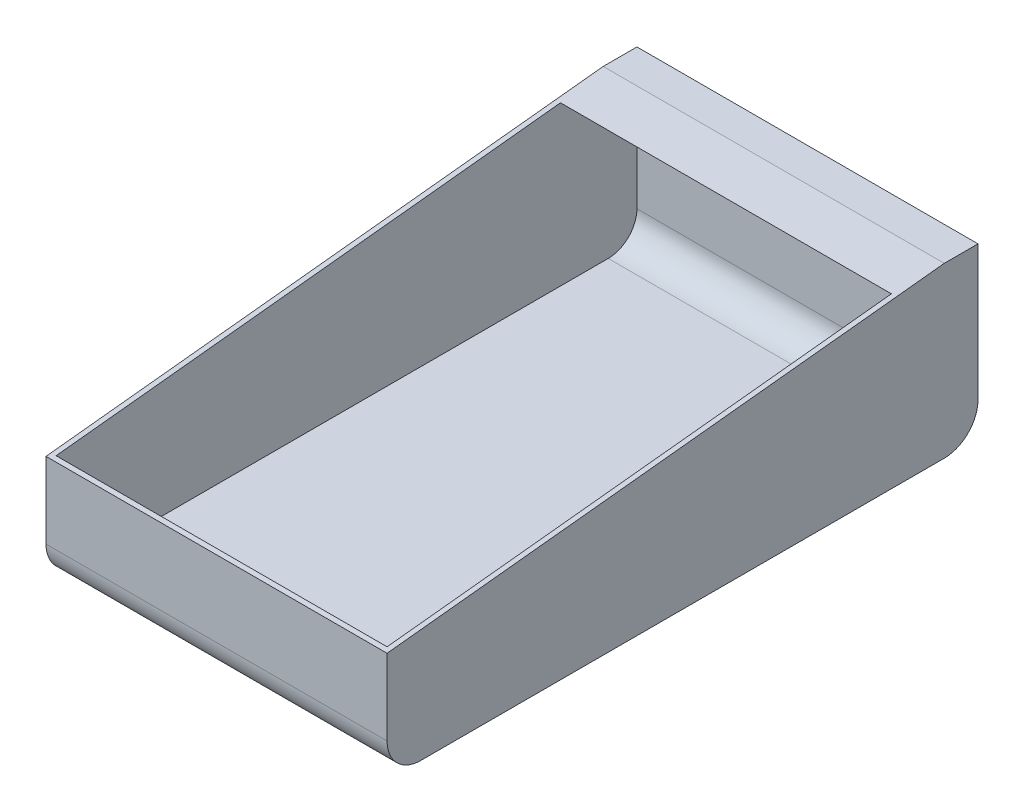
ISO-10303-21;
HEADER;
FILE_DESCRIPTION(('STEP AP214'),'2;1');
FILE_NAME('part.step','',(''),(''),'','','');
FILE_SCHEMA(('AUTOMOTIVE_DESIGN { 1 0 10303 214 1 1 1 1 }'));
ENDSEC;
DATA;
#1=APPLICATION_CONTEXT('core data for automotive mechanical design processes');
#2=APPLICATION_PROTOCOL_DEFINITION('international standard','automotive_design',2000,#1);
#3=PRODUCT_CONTEXT('',#1,'mechanical');
#4=PRODUCT('Part','Part','',(#3));
#5=PRODUCT_RELATED_PRODUCT_CATEGORY('part','',(#4));
#6=PRODUCT_DEFINITION_FORMATION('','',#4);
#7=PRODUCT_DEFINITION_CONTEXT('part definition',#1,'design');
#8=PRODUCT_DEFINITION('design','',#6,#7);
#9=PRODUCT_DEFINITION_SHAPE('','',#8);
#10=(LENGTH_UNIT() NAMED_UNIT(*) SI_UNIT(.MILLI.,.METRE.));
#11=(NAMED_UNIT(*) PLANE_ANGLE_UNIT() SI_UNIT($,.RADIAN.));
#12=(NAMED_UNIT(*) SI_UNIT($,.STERADIAN.) SOLID_ANGLE_UNIT());
#13=UNCERTAINTY_MEASURE_WITH_UNIT(LENGTH_MEASURE(1.E-05),#10,'distance_accuracy_value','');
#14=(GEOMETRIC_REPRESENTATION_CONTEXT(3) GLOBAL_UNCERTAINTY_ASSIGNED_CONTEXT((#13)) GLOBAL_UNIT_ASSIGNED_CONTEXT((#10,
#11,#12)) REPRESENTATION_CONTEXT('',''));
#15=CARTESIAN_POINT('',(0.,0.,0.));
#16=DIRECTION('',(0.,0.,1.));
#17=DIRECTION('',(1.,0.,0.));
#18=AXIS2_PLACEMENT_3D('',#15,#16,#17);
#19=CARTESIAN_POINT('',(0.,100.,-155.000000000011));
#20=DIRECTION('',(0.,0.994422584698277,0.10546906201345));
#21=DIRECTION('',(-1.,0.,0.));
#22=AXIS2_PLACEMENT_3D('',#19,#20,#21);
#23=PLANE('',#22);
#24=DIRECTION('',(0.,0.10546906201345,-0.994422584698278));
#25=VECTOR('',#24,1.);
#26=CARTESIAN_POINT('',(-101.,100.,-155.000000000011));
#27=LINE('',#26,#25);
#28=CARTESIAN_POINT('',(-101.,65.,175.));
#29=VERTEX_POINT('',#28);
#30=CARTESIAN_POINT('',(-101.,100.,-155.000000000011));
#31=VERTEX_POINT('',#30);
#32=EDGE_CURVE('E225',#29,#31,#27,.T.);
#33=ORIENTED_EDGE('',*,*,#32,.F.);
#34=DIRECTION('',(-1.,0.,0.));
#35=VECTOR('',#34,1.);
#36=CARTESIAN_POINT('',(-101.,65.,175.));
#37=LINE('',#36,#35);
#38=CARTESIAN_POINT('',(101.,65.,175.));
#39=VERTEX_POINT('',#38);
#40=EDGE_CURVE('E223',#39,#29,#37,.T.);
#41=ORIENTED_EDGE('',*,*,#40,.F.);
#42=DIRECTION('',(0.,-0.10546906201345,0.994422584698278));
#43=VECTOR('',#42,1.);
#44=CARTESIAN_POINT('',(101.,100.,-155.000000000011));
#45=LINE('',#44,#43);
#46=CARTESIAN_POINT('',(101.,100.,-155.000000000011));
#47=VERTEX_POINT('',#46);
#48=EDGE_CURVE('E221',#47,#39,#45,.T.);
#49=ORIENTED_EDGE('',*,*,#48,.F.);
#50=DIRECTION('',(1.,0.,0.));
#51=VECTOR('',#50,1.);
#52=CARTESIAN_POINT('',(101.,100.,-155.000000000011));
#53=LINE('',#52,#51);
#54=EDGE_CURVE('E218',#31,#47,#53,.T.);
#55=ORIENTED_EDGE('',*,*,#54,.F.);
#56=EDGE_LOOP('',(#33,#41,#49,#55));
#57=FACE_BOUND('',#56,.T.);
#58=DIRECTION('',(-1.,0.,0.));
#59=VECTOR('',#58,1.);
#60=CARTESIAN_POINT('',(0.,65.3181818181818,172.));
#61=LINE('',#60,#59);
#62=CARTESIAN_POINT('',(98.,65.3181818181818,172.));
#63=VERTEX_POINT('',#62);
#64=CARTESIAN_POINT('',(-98.,65.3181818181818,172.));
#65=VERTEX_POINT('',#64);
#66=EDGE_CURVE('E189',#63,#65,#61,.T.);
#67=ORIENTED_EDGE('',*,*,#66,.T.);
#68=DIRECTION('',(0.,0.10546906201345,-0.994422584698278));
#69=VECTOR('',#68,1.);
#70=CARTESIAN_POINT('',(-98.,100.,-155.000000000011));
#71=LINE('',#70,#69);
#72=CARTESIAN_POINT('',(-98.,97.,-126.714285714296));
#73=VERTEX_POINT('',#72);
#74=EDGE_CURVE('E182',#65,#73,#71,.T.);
#75=ORIENTED_EDGE('',*,*,#74,.T.);
#76=DIRECTION('',(1.,0.,0.));
#77=VECTOR('',#76,1.);
#78=CARTESIAN_POINT('',(0.,97.,-126.714285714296));
#79=LINE('',#78,#77);
#80=CARTESIAN_POINT('',(98.,97.,-126.714285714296));
#81=VERTEX_POINT('',#80);
#82=EDGE_CURVE('E152',#73,#81,#79,.T.);
#83=ORIENTED_EDGE('',*,*,#82,.T.);
#84=DIRECTION('',(0.,-0.10546906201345,0.994422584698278));
#85=VECTOR('',#84,1.);
#86=CARTESIAN_POINT('',(98.,100.,-155.000000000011));
#87=LINE('',#86,#85);
#88=EDGE_CURVE('E186',#81,#63,#87,.T.);
#89=ORIENTED_EDGE('',*,*,#88,.T.);
#90=EDGE_LOOP('',(#67,#75,#83,#89));
#91=FACE_BOUND('',#90,.T.);
#92=ADVANCED_FACE('F33',(#57,#91),#23,.T.);
#93=CARTESIAN_POINT('',(101.,100.,-175.));
#94=DIRECTION('',(-1.,0.,0.));
#95=DIRECTION('',(0.,0.,1.));
#96=AXIS2_PLACEMENT_3D('',#93,#94,#95);
#97=PLANE('',#96);
#98=DIRECTION('',(0.,0.,-1.));
#99=VECTOR('',#98,1.);
#100=CARTESIAN_POINT('',(101.,0.,-175.));
#101=LINE('',#100,#99);
#102=CARTESIAN_POINT('',(101.,0.,155.));
#103=VERTEX_POINT('',#102);
#104=CARTESIAN_POINT('',(101.,0.,-155.));
#105=VERTEX_POINT('',#104);
#106=EDGE_CURVE('E146',#103,#105,#101,.T.);
#107=ORIENTED_EDGE('',*,*,#106,.T.);
#108=CARTESIAN_POINT('',(101.,20.,-155.));
#109=DIRECTION('',(-1.,0.,0.));
#110=DIRECTION('',(0.,0.,1.));
#111=AXIS2_PLACEMENT_3D('',#108,#109,#110);
#112=CIRCLE('',#111,20.);
#113=CARTESIAN_POINT('',(101.,20.,-175.));
#114=VERTEX_POINT('',#113);
#115=EDGE_CURVE('E11',#105,#114,#112,.F.);
#116=ORIENTED_EDGE('',*,*,#115,.T.);
#117=DIRECTION('',(0.,-1.,0.));
#118=VECTOR('',#117,1.);
#119=CARTESIAN_POINT('',(101.,100.,-175.));
#120=LINE('',#119,#118);
#121=CARTESIAN_POINT('',(101.,100.,-175.));
#122=VERTEX_POINT('',#121);
#123=EDGE_CURVE('E215',#122,#114,#120,.T.);
#124=ORIENTED_EDGE('',*,*,#123,.F.);
#125=DIRECTION('',(0.,0.,-1.));
#126=VECTOR('',#125,1.);
#127=CARTESIAN_POINT('',(101.,100.,-175.));
#128=LINE('',#127,#126);
#129=EDGE_CURVE('E196',#47,#122,#128,.T.);
#130=ORIENTED_EDGE('',*,*,#129,.F.);
#131=ORIENTED_EDGE('',*,*,#48,.T.);
#132=DIRECTION('',(0.,-1.,0.));
#133=VECTOR('',#132,1.);
#134=CARTESIAN_POINT('',(101.,100.,175.));
#135=LINE('',#134,#133);
#136=CARTESIAN_POINT('',(101.,20.,175.));
#137=VERTEX_POINT('',#136);
#138=EDGE_CURVE('E204',#39,#137,#135,.T.);
#139=ORIENTED_EDGE('',*,*,#138,.T.);
#140=CARTESIAN_POINT('',(101.,20.,155.));
#141=DIRECTION('',(-1.,0.,0.));
#142=DIRECTION('',(0.,0.,1.));
#143=AXIS2_PLACEMENT_3D('',#140,#141,#142);
#144=CIRCLE('',#143,20.);
#145=EDGE_CURVE('E230',#137,#103,#144,.F.);
#146=ORIENTED_EDGE('',*,*,#145,.T.);
#147=EDGE_LOOP('',(#107,#116,#124,#130,#131,#139,#146));
#148=FACE_BOUND('',#147,.T.);
#149=ADVANCED_FACE('F253',(#148),#97,.F.);
#150=CARTESIAN_POINT('',(-101.,100.,-175.));
#151=DIRECTION('',(0.,0.,1.));
#152=DIRECTION('',(1.,0.,0.));
#153=AXIS2_PLACEMENT_3D('',#150,#151,#152);
#154=PLANE('',#153);
#155=ORIENTED_EDGE('',*,*,#123,.T.);
#156=DIRECTION('',(-1.,0.,0.));
#157=VECTOR('',#156,1.);
#158=CARTESIAN_POINT('',(-101.,20.,-175.));
#159=LINE('',#158,#157);
#160=CARTESIAN_POINT('',(-101.,20.,-175.));
#161=VERTEX_POINT('',#160);
#162=EDGE_CURVE('E237',#114,#161,#159,.T.);
#163=ORIENTED_EDGE('',*,*,#162,.T.);
#164=DIRECTION('',(0.,-1.,0.));
#165=VECTOR('',#164,1.);
#166=CARTESIAN_POINT('',(-101.,100.,-175.));
#167=LINE('',#166,#165);
#168=CARTESIAN_POINT('',(-101.,100.,-175.));
#169=VERTEX_POINT('',#168);
#170=EDGE_CURVE('E212',#169,#161,#167,.T.);
#171=ORIENTED_EDGE('',*,*,#170,.F.);
#172=DIRECTION('',(-1.,0.,0.));
#173=VECTOR('',#172,1.);
#174=CARTESIAN_POINT('',(-101.,100.,-175.));
#175=LINE('',#174,#173);
#176=EDGE_CURVE('E198',#122,#169,#175,.T.);
#177=ORIENTED_EDGE('',*,*,#176,.F.);
#178=EDGE_LOOP('',(#155,#163,#171,#177));
#179=FACE_BOUND('',#178,.T.);
#180=ADVANCED_FACE('F257',(#179),#154,.F.);
#181=CARTESIAN_POINT('',(-101.,100.,-175.));
#182=DIRECTION('',(1.,0.,0.));
#183=DIRECTION('',(0.,0.,-1.));
#184=AXIS2_PLACEMENT_3D('',#181,#182,#183);
#185=PLANE('',#184);
#186=ORIENTED_EDGE('',*,*,#170,.T.);
#187=CARTESIAN_POINT('',(-101.,20.,-155.));
#188=DIRECTION('',(1.,0.,0.));
#189=DIRECTION('',(0.,0.,-1.));
#190=AXIS2_PLACEMENT_3D('',#187,#188,#189);
#191=CIRCLE('',#190,20.);
#192=CARTESIAN_POINT('',(-101.,0.,-155.));
#193=VERTEX_POINT('',#192);
#194=EDGE_CURVE('E240',#161,#193,#191,.F.);
#195=ORIENTED_EDGE('',*,*,#194,.T.);
#196=DIRECTION('',(0.,0.,1.));
#197=VECTOR('',#196,1.);
#198=CARTESIAN_POINT('',(-101.,0.,-175.));
#199=LINE('',#198,#197);
#200=CARTESIAN_POINT('',(-101.,0.,155.));
#201=VERTEX_POINT('',#200);
#202=EDGE_CURVE('E199',#193,#201,#199,.T.);
#203=ORIENTED_EDGE('',*,*,#202,.T.);
#204=CARTESIAN_POINT('',(-101.,20.,155.));
#205=DIRECTION('',(1.,0.,0.));
#206=DIRECTION('',(0.,0.,-1.));
#207=AXIS2_PLACEMENT_3D('',#204,#205,#206);
#208=CIRCLE('',#207,20.);
#209=CARTESIAN_POINT('',(-101.,20.,175.));
#210=VERTEX_POINT('',#209);
#211=EDGE_CURVE('E235',#201,#210,#208,.F.);
#212=ORIENTED_EDGE('',*,*,#211,.T.);
#213=DIRECTION('',(0.,-1.,0.));
#214=VECTOR('',#213,1.);
#215=CARTESIAN_POINT('',(-101.,100.,175.));
#216=LINE('',#215,#214);
#217=EDGE_CURVE('E209',#29,#210,#216,.T.);
#218=ORIENTED_EDGE('',*,*,#217,.F.);
#219=ORIENTED_EDGE('',*,*,#32,.T.);
#220=DIRECTION('',(0.,0.,1.));
#221=VECTOR('',#220,1.);
#222=CARTESIAN_POINT('',(-101.,100.,-175.));
#223=LINE('',#222,#221);
#224=EDGE_CURVE('E201',#169,#31,#223,.T.);
#225=ORIENTED_EDGE('',*,*,#224,.F.);
#226=EDGE_LOOP('',(#186,#195,#203,#212,#218,#219,#225));
#227=FACE_BOUND('',#226,.T.);
#228=ADVANCED_FACE('F242',(#227),#185,.F.);
#229=CARTESIAN_POINT('',(-101.,100.,175.));
#230=DIRECTION('',(0.,0.,-1.));
#231=DIRECTION('',(-1.,0.,0.));
#232=AXIS2_PLACEMENT_3D('',#229,#230,#231);
#233=PLANE('',#232);
#234=ORIENTED_EDGE('',*,*,#217,.T.);
#235=DIRECTION('',(1.,0.,0.));
#236=VECTOR('',#235,1.);
#237=CARTESIAN_POINT('',(-101.,20.,175.));
#238=LINE('',#237,#236);
#239=EDGE_CURVE('E227',#210,#137,#238,.T.);
#240=ORIENTED_EDGE('',*,*,#239,.T.);
#241=ORIENTED_EDGE('',*,*,#138,.F.);
#242=ORIENTED_EDGE('',*,*,#40,.T.);
#243=EDGE_LOOP('',(#234,#240,#241,#242));
#244=FACE_BOUND('',#243,.T.);
#245=ADVANCED_FACE('F265',(#244),#233,.F.);
#246=CARTESIAN_POINT('',(0.,100.,0.));
#247=DIRECTION('',(0.,1.,0.));
#248=DIRECTION('',(0.,0.,1.));
#249=AXIS2_PLACEMENT_3D('',#246,#247,#248);
#250=PLANE('',#249);
#251=ORIENTED_EDGE('',*,*,#224,.T.);
#252=ORIENTED_EDGE('',*,*,#54,.T.);
#253=ORIENTED_EDGE('',*,*,#129,.T.);
#254=ORIENTED_EDGE('',*,*,#176,.T.);
#255=EDGE_LOOP('',(#251,#252,#253,#254));
#256=FACE_BOUND('',#255,.T.);
#257=ADVANCED_FACE('F259',(#256),#250,.T.);
#258=CARTESIAN_POINT('',(0.,0.,0.));
#259=DIRECTION('',(0.,1.,0.));
#260=DIRECTION('',(0.,0.,1.));
#261=AXIS2_PLACEMENT_3D('',#258,#259,#260);
#262=PLANE('',#261);
#263=ORIENTED_EDGE('',*,*,#202,.F.);
#264=DIRECTION('',(-1.,0.,0.));
#265=VECTOR('',#264,1.);
#266=CARTESIAN_POINT('',(0.,0.,-155.));
#267=LINE('',#266,#265);
#268=EDGE_CURVE('E41',#193,#105,#267,.F.);
#269=ORIENTED_EDGE('',*,*,#268,.T.);
#270=ORIENTED_EDGE('',*,*,#106,.F.);
#271=DIRECTION('',(1.,0.,0.));
#272=VECTOR('',#271,1.);
#273=CARTESIAN_POINT('',(0.,0.,155.));
#274=LINE('',#273,#272);
#275=EDGE_CURVE('E232',#103,#201,#274,.F.);
#276=ORIENTED_EDGE('',*,*,#275,.T.);
#277=EDGE_LOOP('',(#263,#269,#270,#276));
#278=FACE_BOUND('',#277,.T.);
#279=ADVANCED_FACE('F247',(#278),#262,.F.);
#280=CARTESIAN_POINT('',(-101.,20.,155.));
#281=DIRECTION('',(1.,0.,0.));
#282=DIRECTION('',(0.,0.,-1.));
#283=AXIS2_PLACEMENT_3D('',#280,#281,#282);
#284=CYLINDRICAL_SURFACE('',#283,20.);
#285=ORIENTED_EDGE('',*,*,#211,.F.);
#286=ORIENTED_EDGE('',*,*,#275,.F.);
#287=ORIENTED_EDGE('',*,*,#145,.F.);
#288=ORIENTED_EDGE('',*,*,#239,.F.);
#289=EDGE_LOOP('',(#285,#286,#287,#288));
#290=FACE_BOUND('',#289,.T.);
#291=ADVANCED_FACE('F271',(#290),#284,.T.);
#292=CARTESIAN_POINT('',(-101.,20.,-155.));
#293=DIRECTION('',(-1.,0.,0.));
#294=DIRECTION('',(0.,0.,1.));
#295=AXIS2_PLACEMENT_3D('',#292,#293,#294);
#296=CYLINDRICAL_SURFACE('',#295,20.);
#297=ORIENTED_EDGE('',*,*,#115,.F.);
#298=ORIENTED_EDGE('',*,*,#268,.F.);
#299=ORIENTED_EDGE('',*,*,#194,.F.);
#300=ORIENTED_EDGE('',*,*,#162,.F.);
#301=EDGE_LOOP('',(#297,#298,#299,#300));
#302=FACE_BOUND('',#301,.T.);
#303=ADVANCED_FACE('F35',(#302),#296,.T.);
#304=CARTESIAN_POINT('',(98.,100.,-175.));
#305=DIRECTION('',(-1.,0.,0.));
#306=DIRECTION('',(0.,0.,1.));
#307=AXIS2_PLACEMENT_3D('',#304,#305,#306);
#308=PLANE('',#307);
#309=DIRECTION('',(0.,0.,-1.));
#310=VECTOR('',#309,1.);
#311=CARTESIAN_POINT('',(98.,3.,-175.));
#312=LINE('',#311,#310);
#313=CARTESIAN_POINT('',(98.,3.,155.));
#314=VERTEX_POINT('',#313);
#315=CARTESIAN_POINT('',(98.,3.,-155.));
#316=VERTEX_POINT('',#315);
#317=EDGE_CURVE('E173',#314,#316,#312,.T.);
#318=ORIENTED_EDGE('',*,*,#317,.F.);
#319=CARTESIAN_POINT('',(98.,20.,155.));
#320=DIRECTION('',(-1.,0.,0.));
#321=DIRECTION('',(0.,0.,1.));
#322=AXIS2_PLACEMENT_3D('',#319,#320,#321);
#323=CIRCLE('',#322,17.);
#324=CARTESIAN_POINT('',(98.,20.,172.));
#325=VERTEX_POINT('',#324);
#326=EDGE_CURVE('E165',#325,#314,#323,.F.);
#327=ORIENTED_EDGE('',*,*,#326,.F.);
#328=DIRECTION('',(0.,-1.,0.));
#329=VECTOR('',#328,1.);
#330=CARTESIAN_POINT('',(98.,100.,172.));
#331=LINE('',#330,#329);
#332=EDGE_CURVE('E177',#63,#325,#331,.T.);
#333=ORIENTED_EDGE('',*,*,#332,.F.);
#334=ORIENTED_EDGE('',*,*,#88,.F.);
#335=DIRECTION('',(0.,0.,-1.));
#336=VECTOR('',#335,1.);
#337=CARTESIAN_POINT('',(98.,97.,-175.));
#338=LINE('',#337,#336);
#339=CARTESIAN_POINT('',(98.,97.,-172.));
#340=VERTEX_POINT('',#339);
#341=EDGE_CURVE('E48',#81,#340,#338,.T.);
#342=ORIENTED_EDGE('',*,*,#341,.T.);
#343=DIRECTION('',(0.,-1.,0.));
#344=VECTOR('',#343,1.);
#345=CARTESIAN_POINT('',(98.,100.,-172.));
#346=LINE('',#345,#344);
#347=CARTESIAN_POINT('',(98.,20.,-172.));
#348=VERTEX_POINT('',#347);
#349=EDGE_CURVE('E149',#340,#348,#346,.T.);
#350=ORIENTED_EDGE('',*,*,#349,.T.);
#351=CARTESIAN_POINT('',(98.,20.,-155.));
#352=DIRECTION('',(-1.,0.,0.));
#353=DIRECTION('',(0.,0.,1.));
#354=AXIS2_PLACEMENT_3D('',#351,#352,#353);
#355=CIRCLE('',#354,17.);
#356=EDGE_CURVE('E135',#316,#348,#355,.F.);
#357=ORIENTED_EDGE('',*,*,#356,.F.);
#358=EDGE_LOOP('',(#318,#327,#333,#334,#342,#350,#357));
#359=FACE_BOUND('',#358,.T.);
#360=ADVANCED_FACE('F150',(#359),#308,.T.);
#361=CARTESIAN_POINT('',(-101.,100.,-172.));
#362=DIRECTION('',(0.,0.,1.));
#363=DIRECTION('',(1.,0.,0.));
#364=AXIS2_PLACEMENT_3D('',#361,#362,#363);
#365=PLANE('',#364);
#366=ORIENTED_EDGE('',*,*,#349,.F.);
#367=DIRECTION('',(-1.,0.,0.));
#368=VECTOR('',#367,1.);
#369=CARTESIAN_POINT('',(-101.,97.,-172.));
#370=LINE('',#369,#368);
#371=CARTESIAN_POINT('',(-98.,97.,-172.));
#372=VERTEX_POINT('',#371);
#373=EDGE_CURVE('E169',#340,#372,#370,.T.);
#374=ORIENTED_EDGE('',*,*,#373,.T.);
#375=DIRECTION('',(0.,-1.,0.));
#376=VECTOR('',#375,1.);
#377=CARTESIAN_POINT('',(-98.,100.,-172.));
#378=LINE('',#377,#376);
#379=CARTESIAN_POINT('',(-98.,20.,-172.));
#380=VERTEX_POINT('',#379);
#381=EDGE_CURVE('E153',#372,#380,#378,.T.);
#382=ORIENTED_EDGE('',*,*,#381,.T.);
#383=DIRECTION('',(1.,0.,0.));
#384=VECTOR('',#383,1.);
#385=CARTESIAN_POINT('',(-101.,20.,-172.));
#386=LINE('',#385,#384);
#387=EDGE_CURVE('E139',#348,#380,#386,.F.);
#388=ORIENTED_EDGE('',*,*,#387,.F.);
#389=EDGE_LOOP('',(#366,#374,#382,#388));
#390=FACE_BOUND('',#389,.T.);
#391=ADVANCED_FACE('F155',(#390),#365,.T.);
#392=CARTESIAN_POINT('',(-98.,100.,-175.));
#393=DIRECTION('',(1.,0.,0.));
#394=DIRECTION('',(0.,0.,-1.));
#395=AXIS2_PLACEMENT_3D('',#392,#393,#394);
#396=PLANE('',#395);
#397=ORIENTED_EDGE('',*,*,#381,.F.);
#398=DIRECTION('',(0.,0.,1.));
#399=VECTOR('',#398,1.);
#400=CARTESIAN_POINT('',(-98.,97.,-175.));
#401=LINE('',#400,#399);
#402=EDGE_CURVE('E170',#372,#73,#401,.T.);
#403=ORIENTED_EDGE('',*,*,#402,.T.);
#404=ORIENTED_EDGE('',*,*,#74,.F.);
#405=DIRECTION('',(0.,-1.,0.));
#406=VECTOR('',#405,1.);
#407=CARTESIAN_POINT('',(-98.,100.,172.));
#408=LINE('',#407,#406);
#409=CARTESIAN_POINT('',(-98.,20.,172.));
#410=VERTEX_POINT('',#409);
#411=EDGE_CURVE('E168',#65,#410,#408,.T.);
#412=ORIENTED_EDGE('',*,*,#411,.T.);
#413=CARTESIAN_POINT('',(-98.,20.,155.));
#414=DIRECTION('',(1.,0.,0.));
#415=DIRECTION('',(0.,0.,-1.));
#416=AXIS2_PLACEMENT_3D('',#413,#414,#415);
#417=CIRCLE('',#416,17.);
#418=CARTESIAN_POINT('',(-98.,3.,155.));
#419=VERTEX_POINT('',#418);
#420=EDGE_CURVE('E158',#419,#410,#417,.F.);
#421=ORIENTED_EDGE('',*,*,#420,.F.);
#422=DIRECTION('',(0.,0.,1.));
#423=VECTOR('',#422,1.);
#424=CARTESIAN_POINT('',(-98.,3.,-175.));
#425=LINE('',#424,#423);
#426=CARTESIAN_POINT('',(-98.,3.,-155.));
#427=VERTEX_POINT('',#426);
#428=EDGE_CURVE('E172',#427,#419,#425,.T.);
#429=ORIENTED_EDGE('',*,*,#428,.F.);
#430=CARTESIAN_POINT('',(-98.,20.,-155.));
#431=DIRECTION('',(1.,0.,0.));
#432=DIRECTION('',(0.,0.,-1.));
#433=AXIS2_PLACEMENT_3D('',#430,#431,#432);
#434=CIRCLE('',#433,17.);
#435=EDGE_CURVE('E157',#380,#427,#434,.F.);
#436=ORIENTED_EDGE('',*,*,#435,.F.);
#437=EDGE_LOOP('',(#397,#403,#404,#412,#421,#429,#436));
#438=FACE_BOUND('',#437,.T.);
#439=ADVANCED_FACE('F309',(#438),#396,.T.);
#440=CARTESIAN_POINT('',(-101.,100.,172.));
#441=DIRECTION('',(0.,0.,-1.));
#442=DIRECTION('',(-1.,0.,0.));
#443=AXIS2_PLACEMENT_3D('',#440,#441,#442);
#444=PLANE('',#443);
#445=ORIENTED_EDGE('',*,*,#411,.F.);
#446=ORIENTED_EDGE('',*,*,#66,.F.);
#447=ORIENTED_EDGE('',*,*,#332,.T.);
#448=DIRECTION('',(-1.,0.,0.));
#449=VECTOR('',#448,1.);
#450=CARTESIAN_POINT('',(-101.,20.,172.));
#451=LINE('',#450,#449);
#452=EDGE_CURVE('E179',#410,#325,#451,.F.);
#453=ORIENTED_EDGE('',*,*,#452,.F.);
#454=EDGE_LOOP('',(#445,#446,#447,#453));
#455=FACE_BOUND('',#454,.T.);
#456=ADVANCED_FACE('F306',(#455),#444,.T.);
#457=CARTESIAN_POINT('',(0.,97.,0.));
#458=DIRECTION('',(0.,1.,0.));
#459=DIRECTION('',(0.,0.,1.));
#460=AXIS2_PLACEMENT_3D('',#457,#458,#459);
#461=PLANE('',#460);
#462=ORIENTED_EDGE('',*,*,#402,.F.);
#463=ORIENTED_EDGE('',*,*,#373,.F.);
#464=ORIENTED_EDGE('',*,*,#341,.F.);
#465=ORIENTED_EDGE('',*,*,#82,.F.);
#466=EDGE_LOOP('',(#462,#463,#464,#465));
#467=FACE_BOUND('',#466,.T.);
#468=ADVANCED_FACE('F302',(#467),#461,.F.);
#469=CARTESIAN_POINT('',(0.,3.,0.));
#470=DIRECTION('',(0.,1.,0.));
#471=DIRECTION('',(0.,0.,1.));
#472=AXIS2_PLACEMENT_3D('',#469,#470,#471);
#473=PLANE('',#472);
#474=ORIENTED_EDGE('',*,*,#428,.T.);
#475=DIRECTION('',(1.,0.,0.));
#476=VECTOR('',#475,1.);
#477=CARTESIAN_POINT('',(0.,3.,155.));
#478=LINE('',#477,#476);
#479=EDGE_CURVE('E161',#314,#419,#478,.F.);
#480=ORIENTED_EDGE('',*,*,#479,.F.);
#481=ORIENTED_EDGE('',*,*,#317,.T.);
#482=DIRECTION('',(1.,0.,0.));
#483=VECTOR('',#482,1.);
#484=CARTESIAN_POINT('',(0.,3.,-155.));
#485=LINE('',#484,#483);
#486=EDGE_CURVE('E142',#427,#316,#485,.T.);
#487=ORIENTED_EDGE('',*,*,#486,.F.);
#488=EDGE_LOOP('',(#474,#480,#481,#487));
#489=FACE_BOUND('',#488,.T.);
#490=ADVANCED_FACE('F298',(#489),#473,.T.);
#491=CARTESIAN_POINT('',(-101.,20.,155.));
#492=DIRECTION('',(1.,0.,0.));
#493=DIRECTION('',(0.,0.,-1.));
#494=AXIS2_PLACEMENT_3D('',#491,#492,#493);
#495=CYLINDRICAL_SURFACE('',#494,17.);
#496=ORIENTED_EDGE('',*,*,#420,.T.);
#497=ORIENTED_EDGE('',*,*,#452,.T.);
#498=ORIENTED_EDGE('',*,*,#326,.T.);
#499=ORIENTED_EDGE('',*,*,#479,.T.);
#500=EDGE_LOOP('',(#496,#497,#498,#499));
#501=FACE_BOUND('',#500,.T.);
#502=ADVANCED_FACE('F295',(#501),#495,.F.);
#503=CARTESIAN_POINT('',(-101.,20.,-155.));
#504=DIRECTION('',(-1.,0.,0.));
#505=DIRECTION('',(0.,0.,1.));
#506=AXIS2_PLACEMENT_3D('',#503,#504,#505);
#507=CYLINDRICAL_SURFACE('',#506,17.);
#508=ORIENTED_EDGE('',*,*,#356,.T.);
#509=ORIENTED_EDGE('',*,*,#387,.T.);
#510=ORIENTED_EDGE('',*,*,#435,.T.);
#511=ORIENTED_EDGE('',*,*,#486,.T.);
#512=EDGE_LOOP('',(#508,#509,#510,#511));
#513=FACE_BOUND('',#512,.T.);
#514=ADVANCED_FACE('F137',(#513),#507,.F.);
#515=CLOSED_SHELL('',(#92,#149,#180,#228,#245,#257,#279,#291,#303,#360,#391,#439,#456,#468,#490,
#502,#514));
#516=MANIFOLD_SOLID_BREP('B2',#515);
#517=ADVANCED_BREP_SHAPE_REPRESENTATION('',(#18,#516),#14);
#518=SHAPE_DEFINITION_REPRESENTATION(#9,#517);
ENDSEC;
END-ISO-10303-21;
